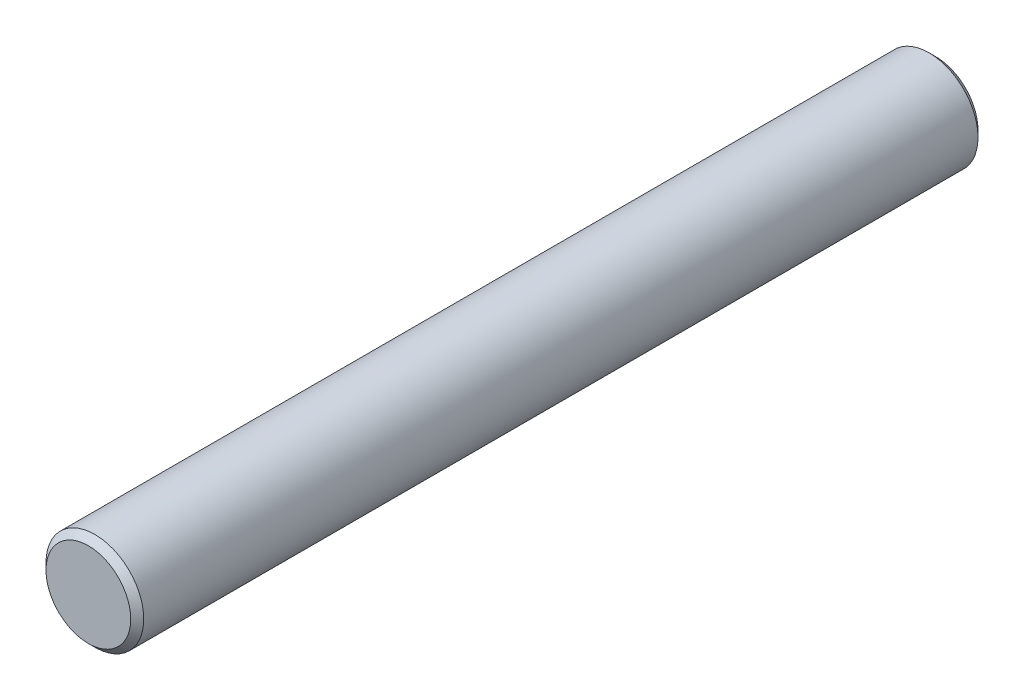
from build123d import *

# Parameters (mm, degrees)
ESQUISSE1_R            = 1.5
CYLINDRE_DE_BASE_DEPTH = 13
CHANFREIN1_SIZE        = 0.2


with BuildPart() as part:
    # Esquisse1 → Cylindre de base (new, symmetric)
    with BuildSketch(Plane.XY):
        with Locations(Location((0, 0, 0), (0, 0, 180))):
            Circle(ESQUISSE1_R)
    extrude(amount=CYLINDRE_DE_BASE_DEPTH, both=True)

    # Chanfrein1
    chanfrein1_edges = [part.edges().sort_by_distance(p)[0] for p in [
        (1.5, 0, -13),
        (1.5, 0, 13),
    ]]
    chamfer(chanfrein1_edges, length=CHANFREIN1_SIZE)


solid = part.part
